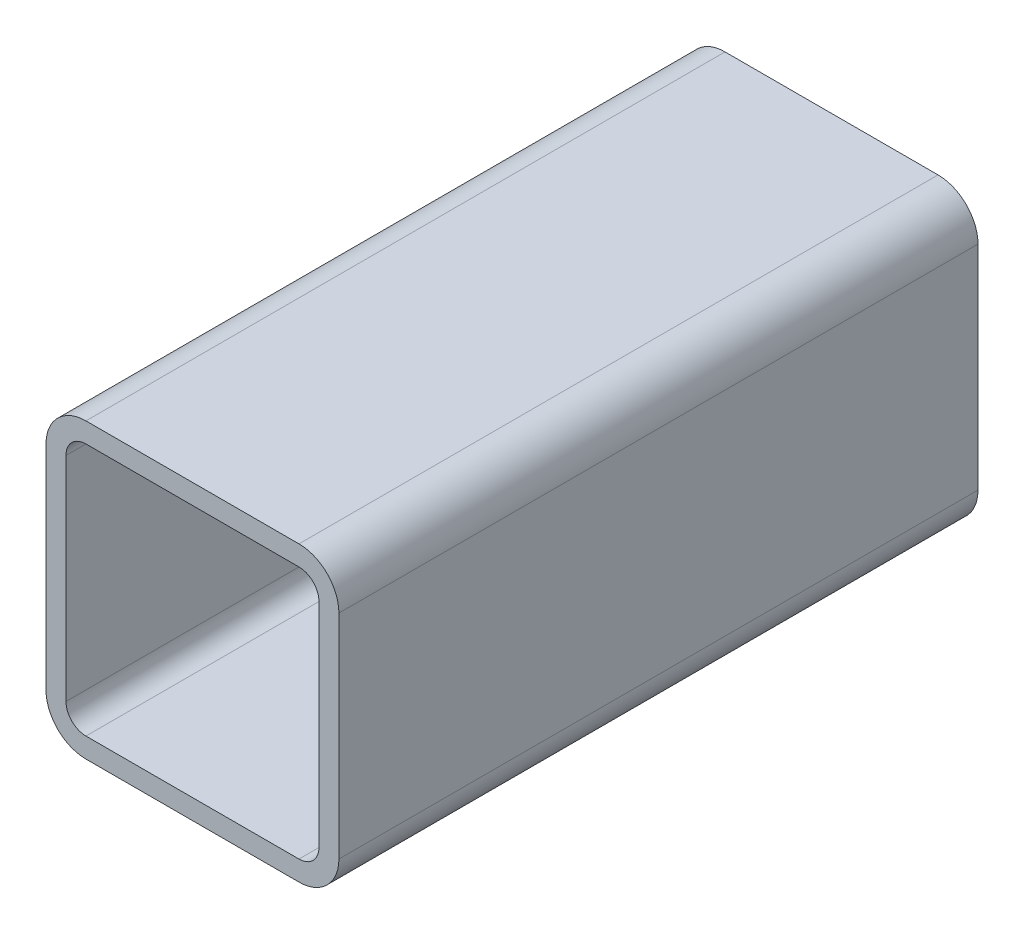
ISO-10303-21;
HEADER;
FILE_DESCRIPTION(('STEP AP214'),'2;1');
FILE_NAME('part.step','',(''),(''),'','','');
FILE_SCHEMA(('AUTOMOTIVE_DESIGN { 1 0 10303 214 1 1 1 1 }'));
ENDSEC;
DATA;
#1=APPLICATION_CONTEXT('core data for automotive mechanical design processes');
#2=APPLICATION_PROTOCOL_DEFINITION('international standard','automotive_design',2000,#1);
#3=PRODUCT_CONTEXT('',#1,'mechanical');
#4=PRODUCT('Part','Part','',(#3));
#5=PRODUCT_RELATED_PRODUCT_CATEGORY('part','',(#4));
#6=PRODUCT_DEFINITION_FORMATION('','',#4);
#7=PRODUCT_DEFINITION_CONTEXT('part definition',#1,'design');
#8=PRODUCT_DEFINITION('design','',#6,#7);
#9=PRODUCT_DEFINITION_SHAPE('','',#8);
#10=(LENGTH_UNIT() NAMED_UNIT(*) SI_UNIT(.MILLI.,.METRE.));
#11=(NAMED_UNIT(*) PLANE_ANGLE_UNIT() SI_UNIT($,.RADIAN.));
#12=(NAMED_UNIT(*) SI_UNIT($,.STERADIAN.) SOLID_ANGLE_UNIT());
#13=UNCERTAINTY_MEASURE_WITH_UNIT(LENGTH_MEASURE(1.E-05),#10,'distance_accuracy_value','');
#14=(GEOMETRIC_REPRESENTATION_CONTEXT(3) GLOBAL_UNCERTAINTY_ASSIGNED_CONTEXT((#13)) GLOBAL_UNIT_ASSIGNED_CONTEXT((#10,
#11,#12)) REPRESENTATION_CONTEXT('',''));
#15=CARTESIAN_POINT('',(0.,0.,0.));
#16=DIRECTION('',(0.,0.,1.));
#17=DIRECTION('',(1.,0.,0.));
#18=AXIS2_PLACEMENT_3D('',#15,#16,#17);
#19=CARTESIAN_POINT('',(19.5042705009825,121.405693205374,304.8));
#20=DIRECTION('',(0.,0.,1.));
#21=DIRECTION('',(1.,0.,0.));
#22=AXIS2_PLACEMENT_3D('',#19,#20,#21);
#23=PLANE('',#22);
#24=CARTESIAN_POINT('',(19.5042705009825,121.405693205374,304.8));
#25=DIRECTION('',(0.,0.,1.));
#26=DIRECTION('',(1.,0.,0.));
#27=AXIS2_PLACEMENT_3D('',#24,#25,#26);
#28=CIRCLE('',#27,19.05);
#29=CARTESIAN_POINT('',(19.5042705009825,140.455693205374,304.8));
#30=VERTEX_POINT('',#29);
#31=CARTESIAN_POINT('',(0.454270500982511,121.405693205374,304.8));
#32=VERTEX_POINT('',#31);
#33=EDGE_CURVE('E211',#30,#32,#28,.T.);
#34=ORIENTED_EDGE('',*,*,#33,.T.);
#35=DIRECTION('',(0.,-1.,0.));
#36=VECTOR('',#35,1.);
#37=CARTESIAN_POINT('',(0.454270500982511,19.8056932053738,304.8));
#38=LINE('',#37,#36);
#39=CARTESIAN_POINT('',(0.454270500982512,19.8056932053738,304.8));
#40=VERTEX_POINT('',#39);
#41=EDGE_CURVE('E214',#32,#40,#38,.T.);
#42=ORIENTED_EDGE('',*,*,#41,.T.);
#43=CARTESIAN_POINT('',(19.5042705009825,19.8056932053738,304.8));
#44=DIRECTION('',(0.,0.,1.));
#45=DIRECTION('',(1.,0.,0.));
#46=AXIS2_PLACEMENT_3D('',#43,#44,#45);
#47=CIRCLE('',#46,19.05);
#48=CARTESIAN_POINT('',(19.5042705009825,0.755693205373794,304.8));
#49=VERTEX_POINT('',#48);
#50=EDGE_CURVE('E217',#40,#49,#47,.T.);
#51=ORIENTED_EDGE('',*,*,#50,.T.);
#52=DIRECTION('',(1.,0.,0.));
#53=VECTOR('',#52,1.);
#54=CARTESIAN_POINT('',(121.104270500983,0.755693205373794,304.8));
#55=LINE('',#54,#53);
#56=CARTESIAN_POINT('',(121.104270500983,0.755693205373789,304.8));
#57=VERTEX_POINT('',#56);
#58=EDGE_CURVE('E219',#49,#57,#55,.T.);
#59=ORIENTED_EDGE('',*,*,#58,.T.);
#60=CARTESIAN_POINT('',(121.104270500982,19.8056932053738,304.8));
#61=DIRECTION('',(0.,0.,1.));
#62=DIRECTION('',(1.,0.,0.));
#63=AXIS2_PLACEMENT_3D('',#60,#61,#62);
#64=CIRCLE('',#63,19.05);
#65=CARTESIAN_POINT('',(140.154270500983,19.8056932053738,304.8));
#66=VERTEX_POINT('',#65);
#67=EDGE_CURVE('E221',#57,#66,#64,.T.);
#68=ORIENTED_EDGE('',*,*,#67,.T.);
#69=DIRECTION('',(0.,1.,0.));
#70=VECTOR('',#69,1.);
#71=CARTESIAN_POINT('',(140.154270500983,121.405693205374,304.8));
#72=LINE('',#71,#70);
#73=CARTESIAN_POINT('',(140.154270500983,121.405693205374,304.8));
#74=VERTEX_POINT('',#73);
#75=EDGE_CURVE('E223',#66,#74,#72,.T.);
#76=ORIENTED_EDGE('',*,*,#75,.T.);
#77=CARTESIAN_POINT('',(121.104270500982,121.405693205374,304.8));
#78=DIRECTION('',(0.,0.,1.));
#79=DIRECTION('',(1.,0.,0.));
#80=AXIS2_PLACEMENT_3D('',#77,#78,#79);
#81=CIRCLE('',#80,19.05);
#82=CARTESIAN_POINT('',(121.104270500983,140.455693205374,304.8));
#83=VERTEX_POINT('',#82);
#84=EDGE_CURVE('E225',#74,#83,#81,.T.);
#85=ORIENTED_EDGE('',*,*,#84,.T.);
#86=DIRECTION('',(-1.,0.,0.));
#87=VECTOR('',#86,1.);
#88=CARTESIAN_POINT('',(19.5042705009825,140.455693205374,304.8));
#89=LINE('',#88,#87);
#90=EDGE_CURVE('E227',#83,#30,#89,.T.);
#91=ORIENTED_EDGE('',*,*,#90,.T.);
#92=EDGE_LOOP('',(#34,#42,#51,#59,#68,#76,#85,#91));
#93=FACE_BOUND('',#92,.T.);
#94=DIRECTION('',(0.,-1.,0.));
#95=VECTOR('',#94,1.);
#96=CARTESIAN_POINT('',(9.97927050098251,19.8056932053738,304.8));
#97=LINE('',#96,#95);
#98=CARTESIAN_POINT('',(9.97927050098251,121.405693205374,304.8));
#99=VERTEX_POINT('',#98);
#100=CARTESIAN_POINT('',(9.97927050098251,19.8056932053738,304.8));
#101=VERTEX_POINT('',#100);
#102=EDGE_CURVE('E154',#99,#101,#97,.T.);
#103=ORIENTED_EDGE('',*,*,#102,.F.);
#104=CARTESIAN_POINT('',(19.5042705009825,121.405693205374,304.8));
#105=DIRECTION('',(0.,0.,1.));
#106=DIRECTION('',(1.,0.,0.));
#107=AXIS2_PLACEMENT_3D('',#104,#105,#106);
#108=CIRCLE('',#107,9.52500000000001);
#109=CARTESIAN_POINT('',(19.5042705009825,130.930693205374,304.8));
#110=VERTEX_POINT('',#109);
#111=EDGE_CURVE('E146',#110,#99,#108,.T.);
#112=ORIENTED_EDGE('',*,*,#111,.F.);
#113=DIRECTION('',(-1.,0.,0.));
#114=VECTOR('',#113,1.);
#115=CARTESIAN_POINT('',(19.5042705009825,130.930693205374,304.8));
#116=LINE('',#115,#114);
#117=CARTESIAN_POINT('',(121.104270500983,130.930693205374,304.8));
#118=VERTEX_POINT('',#117);
#119=EDGE_CURVE('E179',#118,#110,#116,.T.);
#120=ORIENTED_EDGE('',*,*,#119,.F.);
#121=CARTESIAN_POINT('',(121.104270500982,121.405693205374,304.8));
#122=DIRECTION('',(0.,0.,1.));
#123=DIRECTION('',(1.,0.,0.));
#124=AXIS2_PLACEMENT_3D('',#121,#122,#123);
#125=CIRCLE('',#124,9.52500000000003);
#126=CARTESIAN_POINT('',(130.629270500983,121.405693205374,304.8));
#127=VERTEX_POINT('',#126);
#128=EDGE_CURVE('E177',#127,#118,#125,.T.);
#129=ORIENTED_EDGE('',*,*,#128,.F.);
#130=DIRECTION('',(0.,1.,0.));
#131=VECTOR('',#130,1.);
#132=CARTESIAN_POINT('',(130.629270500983,121.405693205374,304.8));
#133=LINE('',#132,#131);
#134=CARTESIAN_POINT('',(130.629270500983,19.8056932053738,304.8));
#135=VERTEX_POINT('',#134);
#136=EDGE_CURVE('E175',#135,#127,#133,.T.);
#137=ORIENTED_EDGE('',*,*,#136,.F.);
#138=CARTESIAN_POINT('',(121.104270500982,19.8056932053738,304.8));
#139=DIRECTION('',(0.,0.,1.));
#140=DIRECTION('',(1.,0.,0.));
#141=AXIS2_PLACEMENT_3D('',#138,#139,#140);
#142=CIRCLE('',#141,9.52500000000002);
#143=CARTESIAN_POINT('',(121.104270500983,10.2806932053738,304.8));
#144=VERTEX_POINT('',#143);
#145=EDGE_CURVE('E173',#144,#135,#142,.T.);
#146=ORIENTED_EDGE('',*,*,#145,.F.);
#147=DIRECTION('',(1.,0.,0.));
#148=VECTOR('',#147,1.);
#149=CARTESIAN_POINT('',(121.104270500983,10.2806932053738,304.8));
#150=LINE('',#149,#148);
#151=CARTESIAN_POINT('',(19.5042705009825,10.2806932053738,304.8));
#152=VERTEX_POINT('',#151);
#153=EDGE_CURVE('E169',#152,#144,#150,.T.);
#154=ORIENTED_EDGE('',*,*,#153,.F.);
#155=CARTESIAN_POINT('',(19.5042705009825,19.8056932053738,304.8));
#156=DIRECTION('',(0.,0.,1.));
#157=DIRECTION('',(1.,0.,0.));
#158=AXIS2_PLACEMENT_3D('',#155,#156,#157);
#159=CIRCLE('',#158,9.525);
#160=EDGE_CURVE('E167',#101,#152,#159,.T.);
#161=ORIENTED_EDGE('',*,*,#160,.F.);
#162=EDGE_LOOP('',(#103,#112,#120,#129,#137,#146,#154,#161));
#163=FACE_BOUND('',#162,.T.);
#164=ADVANCED_FACE('F33',(#93,#163),#23,.T.);
#165=CARTESIAN_POINT('',(19.5042705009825,121.405693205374,0.));
#166=DIRECTION('',(0.,0.,1.));
#167=DIRECTION('',(1.,0.,0.));
#168=AXIS2_PLACEMENT_3D('',#165,#166,#167);
#169=PLANE('',#168);
#170=CARTESIAN_POINT('',(19.5042705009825,121.405693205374,0.));
#171=DIRECTION('',(0.,0.,1.));
#172=DIRECTION('',(1.,0.,0.));
#173=AXIS2_PLACEMENT_3D('',#170,#171,#172);
#174=CIRCLE('',#173,19.05);
#175=CARTESIAN_POINT('',(19.5042705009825,140.455693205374,0.));
#176=VERTEX_POINT('',#175);
#177=CARTESIAN_POINT('',(0.454270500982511,121.405693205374,0.));
#178=VERTEX_POINT('',#177);
#179=EDGE_CURVE('E162',#176,#178,#174,.T.);
#180=ORIENTED_EDGE('',*,*,#179,.F.);
#181=DIRECTION('',(-1.,0.,0.));
#182=VECTOR('',#181,1.);
#183=CARTESIAN_POINT('',(19.5042705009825,140.455693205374,0.));
#184=LINE('',#183,#182);
#185=CARTESIAN_POINT('',(121.104270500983,140.455693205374,0.));
#186=VERTEX_POINT('',#185);
#187=EDGE_CURVE('E215',#186,#176,#184,.T.);
#188=ORIENTED_EDGE('',*,*,#187,.F.);
#189=CARTESIAN_POINT('',(121.104270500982,121.405693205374,0.));
#190=DIRECTION('',(0.,0.,1.));
#191=DIRECTION('',(1.,0.,0.));
#192=AXIS2_PLACEMENT_3D('',#189,#190,#191);
#193=CIRCLE('',#192,19.05);
#194=CARTESIAN_POINT('',(140.154270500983,121.405693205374,0.));
#195=VERTEX_POINT('',#194);
#196=EDGE_CURVE('E242',#195,#186,#193,.T.);
#197=ORIENTED_EDGE('',*,*,#196,.F.);
#198=DIRECTION('',(0.,1.,0.));
#199=VECTOR('',#198,1.);
#200=CARTESIAN_POINT('',(140.154270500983,121.405693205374,0.));
#201=LINE('',#200,#199);
#202=CARTESIAN_POINT('',(140.154270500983,19.8056932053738,0.));
#203=VERTEX_POINT('',#202);
#204=EDGE_CURVE('E240',#203,#195,#201,.T.);
#205=ORIENTED_EDGE('',*,*,#204,.F.);
#206=CARTESIAN_POINT('',(121.104270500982,19.8056932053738,0.));
#207=DIRECTION('',(0.,0.,1.));
#208=DIRECTION('',(1.,0.,0.));
#209=AXIS2_PLACEMENT_3D('',#206,#207,#208);
#210=CIRCLE('',#209,19.05);
#211=CARTESIAN_POINT('',(121.104270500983,0.755693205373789,0.));
#212=VERTEX_POINT('',#211);
#213=EDGE_CURVE('E238',#212,#203,#210,.T.);
#214=ORIENTED_EDGE('',*,*,#213,.F.);
#215=DIRECTION('',(1.,0.,0.));
#216=VECTOR('',#215,1.);
#217=CARTESIAN_POINT('',(121.104270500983,0.755693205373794,0.));
#218=LINE('',#217,#216);
#219=CARTESIAN_POINT('',(19.5042705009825,0.755693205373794,0.));
#220=VERTEX_POINT('',#219);
#221=EDGE_CURVE('E236',#220,#212,#218,.T.);
#222=ORIENTED_EDGE('',*,*,#221,.F.);
#223=CARTESIAN_POINT('',(19.5042705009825,19.8056932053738,0.));
#224=DIRECTION('',(0.,0.,1.));
#225=DIRECTION('',(1.,0.,0.));
#226=AXIS2_PLACEMENT_3D('',#223,#224,#225);
#227=CIRCLE('',#226,19.05);
#228=CARTESIAN_POINT('',(0.454270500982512,19.8056932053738,0.));
#229=VERTEX_POINT('',#228);
#230=EDGE_CURVE('E234',#229,#220,#227,.T.);
#231=ORIENTED_EDGE('',*,*,#230,.F.);
#232=DIRECTION('',(0.,-1.,0.));
#233=VECTOR('',#232,1.);
#234=CARTESIAN_POINT('',(0.454270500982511,19.8056932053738,0.));
#235=LINE('',#234,#233);
#236=EDGE_CURVE('E232',#178,#229,#235,.T.);
#237=ORIENTED_EDGE('',*,*,#236,.F.);
#238=EDGE_LOOP('',(#180,#188,#197,#205,#214,#222,#231,#237));
#239=FACE_BOUND('',#238,.T.);
#240=CARTESIAN_POINT('',(19.5042705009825,121.405693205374,0.));
#241=DIRECTION('',(0.,0.,1.));
#242=DIRECTION('',(1.,0.,0.));
#243=AXIS2_PLACEMENT_3D('',#240,#241,#242);
#244=CIRCLE('',#243,9.52500000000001);
#245=CARTESIAN_POINT('',(19.5042705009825,130.930693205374,0.));
#246=VERTEX_POINT('',#245);
#247=CARTESIAN_POINT('',(9.97927050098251,121.405693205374,0.));
#248=VERTEX_POINT('',#247);
#249=EDGE_CURVE('E56',#246,#248,#244,.T.);
#250=ORIENTED_EDGE('',*,*,#249,.T.);
#251=DIRECTION('',(0.,-1.,0.));
#252=VECTOR('',#251,1.);
#253=CARTESIAN_POINT('',(9.97927050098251,19.8056932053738,0.));
#254=LINE('',#253,#252);
#255=CARTESIAN_POINT('',(9.97927050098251,19.8056932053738,0.));
#256=VERTEX_POINT('',#255);
#257=EDGE_CURVE('E161',#248,#256,#254,.T.);
#258=ORIENTED_EDGE('',*,*,#257,.T.);
#259=CARTESIAN_POINT('',(19.5042705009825,19.8056932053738,0.));
#260=DIRECTION('',(0.,0.,1.));
#261=DIRECTION('',(1.,0.,0.));
#262=AXIS2_PLACEMENT_3D('',#259,#260,#261);
#263=CIRCLE('',#262,9.525);
#264=CARTESIAN_POINT('',(19.5042705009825,10.2806932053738,0.));
#265=VERTEX_POINT('',#264);
#266=EDGE_CURVE('E183',#256,#265,#263,.T.);
#267=ORIENTED_EDGE('',*,*,#266,.T.);
#268=DIRECTION('',(1.,0.,0.));
#269=VECTOR('',#268,1.);
#270=CARTESIAN_POINT('',(121.104270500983,10.2806932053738,0.));
#271=LINE('',#270,#269);
#272=CARTESIAN_POINT('',(121.104270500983,10.2806932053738,0.));
#273=VERTEX_POINT('',#272);
#274=EDGE_CURVE('E186',#265,#273,#271,.T.);
#275=ORIENTED_EDGE('',*,*,#274,.T.);
#276=CARTESIAN_POINT('',(121.104270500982,19.8056932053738,0.));
#277=DIRECTION('',(0.,0.,1.));
#278=DIRECTION('',(1.,0.,0.));
#279=AXIS2_PLACEMENT_3D('',#276,#277,#278);
#280=CIRCLE('',#279,9.52500000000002);
#281=CARTESIAN_POINT('',(130.629270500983,19.8056932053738,0.));
#282=VERTEX_POINT('',#281);
#283=EDGE_CURVE('E189',#273,#282,#280,.T.);
#284=ORIENTED_EDGE('',*,*,#283,.T.);
#285=DIRECTION('',(0.,1.,0.));
#286=VECTOR('',#285,1.);
#287=CARTESIAN_POINT('',(130.629270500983,121.405693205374,0.));
#288=LINE('',#287,#286);
#289=CARTESIAN_POINT('',(130.629270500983,121.405693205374,0.));
#290=VERTEX_POINT('',#289);
#291=EDGE_CURVE('E192',#282,#290,#288,.T.);
#292=ORIENTED_EDGE('',*,*,#291,.T.);
#293=CARTESIAN_POINT('',(121.104270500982,121.405693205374,0.));
#294=DIRECTION('',(0.,0.,1.));
#295=DIRECTION('',(1.,0.,0.));
#296=AXIS2_PLACEMENT_3D('',#293,#294,#295);
#297=CIRCLE('',#296,9.52500000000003);
#298=CARTESIAN_POINT('',(121.104270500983,130.930693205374,0.));
#299=VERTEX_POINT('',#298);
#300=EDGE_CURVE('E195',#290,#299,#297,.T.);
#301=ORIENTED_EDGE('',*,*,#300,.T.);
#302=DIRECTION('',(-1.,0.,0.));
#303=VECTOR('',#302,1.);
#304=CARTESIAN_POINT('',(19.5042705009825,130.930693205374,0.));
#305=LINE('',#304,#303);
#306=EDGE_CURVE('E155',#299,#246,#305,.T.);
#307=ORIENTED_EDGE('',*,*,#306,.T.);
#308=EDGE_LOOP('',(#250,#258,#267,#275,#284,#292,#301,#307));
#309=FACE_BOUND('',#308,.T.);
#310=ADVANCED_FACE('F272',(#239,#309),#169,.F.);
#311=CARTESIAN_POINT('',(19.5042705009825,121.405693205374,304.8));
#312=DIRECTION('',(0.,0.,-1.));
#313=DIRECTION('',(-1.,0.,0.));
#314=AXIS2_PLACEMENT_3D('',#311,#312,#313);
#315=CYLINDRICAL_SURFACE('',#314,19.05);
#316=ORIENTED_EDGE('',*,*,#179,.T.);
#317=DIRECTION('',(0.,0.,-1.));
#318=VECTOR('',#317,1.);
#319=CARTESIAN_POINT('',(0.454270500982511,121.405693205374,304.8));
#320=LINE('',#319,#318);
#321=EDGE_CURVE('E11',#32,#178,#320,.T.);
#322=ORIENTED_EDGE('',*,*,#321,.F.);
#323=ORIENTED_EDGE('',*,*,#33,.F.);
#324=DIRECTION('',(0.,0.,-1.));
#325=VECTOR('',#324,1.);
#326=CARTESIAN_POINT('',(19.5042705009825,140.455693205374,304.8));
#327=LINE('',#326,#325);
#328=EDGE_CURVE('E229',#30,#176,#327,.T.);
#329=ORIENTED_EDGE('',*,*,#328,.T.);
#330=EDGE_LOOP('',(#316,#322,#323,#329));
#331=FACE_BOUND('',#330,.T.);
#332=ADVANCED_FACE('F35',(#331),#315,.T.);
#333=CARTESIAN_POINT('',(0.454270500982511,19.8056932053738,304.8));
#334=DIRECTION('',(1.,0.,0.));
#335=DIRECTION('',(0.,0.,-1.));
#336=AXIS2_PLACEMENT_3D('',#333,#334,#335);
#337=PLANE('',#336);
#338=ORIENTED_EDGE('',*,*,#236,.T.);
#339=DIRECTION('',(0.,0.,-1.));
#340=VECTOR('',#339,1.);
#341=CARTESIAN_POINT('',(0.454270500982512,19.8056932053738,304.8));
#342=LINE('',#341,#340);
#343=EDGE_CURVE('E41',#40,#229,#342,.T.);
#344=ORIENTED_EDGE('',*,*,#343,.F.);
#345=ORIENTED_EDGE('',*,*,#41,.F.);
#346=ORIENTED_EDGE('',*,*,#321,.T.);
#347=EDGE_LOOP('',(#338,#344,#345,#346));
#348=FACE_BOUND('',#347,.T.);
#349=ADVANCED_FACE('F289',(#348),#337,.F.);
#350=CARTESIAN_POINT('',(19.5042705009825,19.8056932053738,304.8));
#351=DIRECTION('',(0.,0.,-1.));
#352=DIRECTION('',(-1.,0.,0.));
#353=AXIS2_PLACEMENT_3D('',#350,#351,#352);
#354=CYLINDRICAL_SURFACE('',#353,19.05);
#355=ORIENTED_EDGE('',*,*,#230,.T.);
#356=DIRECTION('',(0.,0.,-1.));
#357=VECTOR('',#356,1.);
#358=CARTESIAN_POINT('',(19.5042705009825,0.755693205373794,304.8));
#359=LINE('',#358,#357);
#360=EDGE_CURVE('E259',#49,#220,#359,.T.);
#361=ORIENTED_EDGE('',*,*,#360,.F.);
#362=ORIENTED_EDGE('',*,*,#50,.F.);
#363=ORIENTED_EDGE('',*,*,#343,.T.);
#364=EDGE_LOOP('',(#355,#361,#362,#363));
#365=FACE_BOUND('',#364,.T.);
#366=ADVANCED_FACE('F266',(#365),#354,.T.);
#367=CARTESIAN_POINT('',(121.104270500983,0.755693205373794,304.8));
#368=DIRECTION('',(0.,1.,0.));
#369=DIRECTION('',(0.,0.,1.));
#370=AXIS2_PLACEMENT_3D('',#367,#368,#369);
#371=PLANE('',#370);
#372=ORIENTED_EDGE('',*,*,#221,.T.);
#373=DIRECTION('',(0.,0.,-1.));
#374=VECTOR('',#373,1.);
#375=CARTESIAN_POINT('',(121.104270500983,0.755693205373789,304.8));
#376=LINE('',#375,#374);
#377=EDGE_CURVE('E256',#57,#212,#376,.T.);
#378=ORIENTED_EDGE('',*,*,#377,.F.);
#379=ORIENTED_EDGE('',*,*,#58,.F.);
#380=ORIENTED_EDGE('',*,*,#360,.T.);
#381=EDGE_LOOP('',(#372,#378,#379,#380));
#382=FACE_BOUND('',#381,.T.);
#383=ADVANCED_FACE('F278',(#382),#371,.F.);
#384=CARTESIAN_POINT('',(121.104270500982,19.8056932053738,304.8));
#385=DIRECTION('',(0.,0.,-1.));
#386=DIRECTION('',(-1.,0.,0.));
#387=AXIS2_PLACEMENT_3D('',#384,#385,#386);
#388=CYLINDRICAL_SURFACE('',#387,19.05);
#389=ORIENTED_EDGE('',*,*,#213,.T.);
#390=DIRECTION('',(0.,0.,-1.));
#391=VECTOR('',#390,1.);
#392=CARTESIAN_POINT('',(140.154270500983,19.8056932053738,304.8));
#393=LINE('',#392,#391);
#394=EDGE_CURVE('E253',#66,#203,#393,.T.);
#395=ORIENTED_EDGE('',*,*,#394,.F.);
#396=ORIENTED_EDGE('',*,*,#67,.F.);
#397=ORIENTED_EDGE('',*,*,#377,.T.);
#398=EDGE_LOOP('',(#389,#395,#396,#397));
#399=FACE_BOUND('',#398,.T.);
#400=ADVANCED_FACE('F282',(#399),#388,.T.);
#401=CARTESIAN_POINT('',(140.154270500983,121.405693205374,304.8));
#402=DIRECTION('',(-1.,0.,0.));
#403=DIRECTION('',(0.,0.,1.));
#404=AXIS2_PLACEMENT_3D('',#401,#402,#403);
#405=PLANE('',#404);
#406=ORIENTED_EDGE('',*,*,#204,.T.);
#407=DIRECTION('',(0.,0.,-1.));
#408=VECTOR('',#407,1.);
#409=CARTESIAN_POINT('',(140.154270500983,121.405693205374,304.8));
#410=LINE('',#409,#408);
#411=EDGE_CURVE('E250',#74,#195,#410,.T.);
#412=ORIENTED_EDGE('',*,*,#411,.F.);
#413=ORIENTED_EDGE('',*,*,#75,.F.);
#414=ORIENTED_EDGE('',*,*,#394,.T.);
#415=EDGE_LOOP('',(#406,#412,#413,#414));
#416=FACE_BOUND('',#415,.T.);
#417=ADVANCED_FACE('F302',(#416),#405,.F.);
#418=CARTESIAN_POINT('',(121.104270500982,121.405693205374,304.8));
#419=DIRECTION('',(0.,0.,-1.));
#420=DIRECTION('',(-1.,0.,0.));
#421=AXIS2_PLACEMENT_3D('',#418,#419,#420);
#422=CYLINDRICAL_SURFACE('',#421,19.05);
#423=ORIENTED_EDGE('',*,*,#196,.T.);
#424=DIRECTION('',(0.,0.,-1.));
#425=VECTOR('',#424,1.);
#426=CARTESIAN_POINT('',(121.104270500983,140.455693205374,304.8));
#427=LINE('',#426,#425);
#428=EDGE_CURVE('E247',#83,#186,#427,.T.);
#429=ORIENTED_EDGE('',*,*,#428,.F.);
#430=ORIENTED_EDGE('',*,*,#84,.F.);
#431=ORIENTED_EDGE('',*,*,#411,.T.);
#432=EDGE_LOOP('',(#423,#429,#430,#431));
#433=FACE_BOUND('',#432,.T.);
#434=ADVANCED_FACE('F300',(#433),#422,.T.);
#435=CARTESIAN_POINT('',(19.5042705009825,140.455693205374,304.8));
#436=DIRECTION('',(0.,-1.,0.));
#437=DIRECTION('',(0.,0.,-1.));
#438=AXIS2_PLACEMENT_3D('',#435,#436,#437);
#439=PLANE('',#438);
#440=ORIENTED_EDGE('',*,*,#187,.T.);
#441=ORIENTED_EDGE('',*,*,#328,.F.);
#442=ORIENTED_EDGE('',*,*,#90,.F.);
#443=ORIENTED_EDGE('',*,*,#428,.T.);
#444=EDGE_LOOP('',(#440,#441,#442,#443));
#445=FACE_BOUND('',#444,.T.);
#446=ADVANCED_FACE('F295',(#445),#439,.F.);
#447=CARTESIAN_POINT('',(19.5042705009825,121.405693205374,304.8));
#448=DIRECTION('',(0.,0.,-1.));
#449=DIRECTION('',(-1.,0.,0.));
#450=AXIS2_PLACEMENT_3D('',#447,#448,#449);
#451=CYLINDRICAL_SURFACE('',#450,9.52500000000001);
#452=ORIENTED_EDGE('',*,*,#249,.F.);
#453=DIRECTION('',(0.,0.,-1.));
#454=VECTOR('',#453,1.);
#455=CARTESIAN_POINT('',(19.5042705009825,130.930693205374,304.8));
#456=LINE('',#455,#454);
#457=EDGE_CURVE('E150',#110,#246,#456,.T.);
#458=ORIENTED_EDGE('',*,*,#457,.F.);
#459=ORIENTED_EDGE('',*,*,#111,.T.);
#460=DIRECTION('',(0.,0.,-1.));
#461=VECTOR('',#460,1.);
#462=CARTESIAN_POINT('',(9.97927050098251,121.405693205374,304.8));
#463=LINE('',#462,#461);
#464=EDGE_CURVE('E149',#99,#248,#463,.T.);
#465=ORIENTED_EDGE('',*,*,#464,.T.);
#466=EDGE_LOOP('',(#452,#458,#459,#465));
#467=FACE_BOUND('',#466,.T.);
#468=ADVANCED_FACE('F148',(#467),#451,.F.);
#469=CARTESIAN_POINT('',(9.97927050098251,19.8056932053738,304.8));
#470=DIRECTION('',(1.,0.,0.));
#471=DIRECTION('',(0.,0.,-1.));
#472=AXIS2_PLACEMENT_3D('',#469,#470,#471);
#473=PLANE('',#472);
#474=ORIENTED_EDGE('',*,*,#257,.F.);
#475=ORIENTED_EDGE('',*,*,#464,.F.);
#476=ORIENTED_EDGE('',*,*,#102,.T.);
#477=DIRECTION('',(0.,0.,-1.));
#478=VECTOR('',#477,1.);
#479=CARTESIAN_POINT('',(9.97927050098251,19.8056932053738,304.8));
#480=LINE('',#479,#478);
#481=EDGE_CURVE('E163',#101,#256,#480,.T.);
#482=ORIENTED_EDGE('',*,*,#481,.T.);
#483=EDGE_LOOP('',(#474,#475,#476,#482));
#484=FACE_BOUND('',#483,.T.);
#485=ADVANCED_FACE('F158',(#484),#473,.T.);
#486=CARTESIAN_POINT('',(19.5042705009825,19.8056932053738,304.8));
#487=DIRECTION('',(0.,0.,-1.));
#488=DIRECTION('',(-1.,0.,0.));
#489=AXIS2_PLACEMENT_3D('',#486,#487,#488);
#490=CYLINDRICAL_SURFACE('',#489,9.525);
#491=ORIENTED_EDGE('',*,*,#266,.F.);
#492=ORIENTED_EDGE('',*,*,#481,.F.);
#493=ORIENTED_EDGE('',*,*,#160,.T.);
#494=DIRECTION('',(0.,0.,-1.));
#495=VECTOR('',#494,1.);
#496=CARTESIAN_POINT('',(19.5042705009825,10.2806932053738,304.8));
#497=LINE('',#496,#495);
#498=EDGE_CURVE('E208',#152,#265,#497,.T.);
#499=ORIENTED_EDGE('',*,*,#498,.T.);
#500=EDGE_LOOP('',(#491,#492,#493,#499));
#501=FACE_BOUND('',#500,.T.);
#502=ADVANCED_FACE('F327',(#501),#490,.F.);
#503=CARTESIAN_POINT('',(121.104270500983,10.2806932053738,304.8));
#504=DIRECTION('',(0.,1.,0.));
#505=DIRECTION('',(0.,0.,1.));
#506=AXIS2_PLACEMENT_3D('',#503,#504,#505);
#507=PLANE('',#506);
#508=ORIENTED_EDGE('',*,*,#274,.F.);
#509=ORIENTED_EDGE('',*,*,#498,.F.);
#510=ORIENTED_EDGE('',*,*,#153,.T.);
#511=DIRECTION('',(0.,0.,-1.));
#512=VECTOR('',#511,1.);
#513=CARTESIAN_POINT('',(121.104270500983,10.2806932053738,304.8));
#514=LINE('',#513,#512);
#515=EDGE_CURVE('E206',#144,#273,#514,.T.);
#516=ORIENTED_EDGE('',*,*,#515,.T.);
#517=EDGE_LOOP('',(#508,#509,#510,#516));
#518=FACE_BOUND('',#517,.T.);
#519=ADVANCED_FACE('F331',(#518),#507,.T.);
#520=CARTESIAN_POINT('',(121.104270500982,19.8056932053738,304.8));
#521=DIRECTION('',(0.,0.,-1.));
#522=DIRECTION('',(-1.,0.,0.));
#523=AXIS2_PLACEMENT_3D('',#520,#521,#522);
#524=CYLINDRICAL_SURFACE('',#523,9.52500000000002);
#525=ORIENTED_EDGE('',*,*,#283,.F.);
#526=ORIENTED_EDGE('',*,*,#515,.F.);
#527=ORIENTED_EDGE('',*,*,#145,.T.);
#528=DIRECTION('',(0.,0.,-1.));
#529=VECTOR('',#528,1.);
#530=CARTESIAN_POINT('',(130.629270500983,19.8056932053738,304.8));
#531=LINE('',#530,#529);
#532=EDGE_CURVE('E204',#135,#282,#531,.T.);
#533=ORIENTED_EDGE('',*,*,#532,.T.);
#534=EDGE_LOOP('',(#525,#526,#527,#533));
#535=FACE_BOUND('',#534,.T.);
#536=ADVANCED_FACE('F337',(#535),#524,.F.);
#537=CARTESIAN_POINT('',(130.629270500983,121.405693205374,304.8));
#538=DIRECTION('',(-1.,0.,0.));
#539=DIRECTION('',(0.,0.,1.));
#540=AXIS2_PLACEMENT_3D('',#537,#538,#539);
#541=PLANE('',#540);
#542=ORIENTED_EDGE('',*,*,#291,.F.);
#543=ORIENTED_EDGE('',*,*,#532,.F.);
#544=ORIENTED_EDGE('',*,*,#136,.T.);
#545=DIRECTION('',(0.,0.,-1.));
#546=VECTOR('',#545,1.);
#547=CARTESIAN_POINT('',(130.629270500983,121.405693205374,304.8));
#548=LINE('',#547,#546);
#549=EDGE_CURVE('E202',#127,#290,#548,.T.);
#550=ORIENTED_EDGE('',*,*,#549,.T.);
#551=EDGE_LOOP('',(#542,#543,#544,#550));
#552=FACE_BOUND('',#551,.T.);
#553=ADVANCED_FACE('F341',(#552),#541,.T.);
#554=CARTESIAN_POINT('',(121.104270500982,121.405693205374,304.8));
#555=DIRECTION('',(0.,0.,-1.));
#556=DIRECTION('',(-1.,0.,0.));
#557=AXIS2_PLACEMENT_3D('',#554,#555,#556);
#558=CYLINDRICAL_SURFACE('',#557,9.52500000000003);
#559=ORIENTED_EDGE('',*,*,#300,.F.);
#560=ORIENTED_EDGE('',*,*,#549,.F.);
#561=ORIENTED_EDGE('',*,*,#128,.T.);
#562=DIRECTION('',(0.,0.,-1.));
#563=VECTOR('',#562,1.);
#564=CARTESIAN_POINT('',(121.104270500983,130.930693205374,304.8));
#565=LINE('',#564,#563);
#566=EDGE_CURVE('E48',#118,#299,#565,.T.);
#567=ORIENTED_EDGE('',*,*,#566,.T.);
#568=EDGE_LOOP('',(#559,#560,#561,#567));
#569=FACE_BOUND('',#568,.T.);
#570=ADVANCED_FACE('F345',(#569),#558,.F.);
#571=CARTESIAN_POINT('',(19.5042705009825,130.930693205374,304.8));
#572=DIRECTION('',(0.,-1.,0.));
#573=DIRECTION('',(0.,0.,-1.));
#574=AXIS2_PLACEMENT_3D('',#571,#572,#573);
#575=PLANE('',#574);
#576=ORIENTED_EDGE('',*,*,#306,.F.);
#577=ORIENTED_EDGE('',*,*,#566,.F.);
#578=ORIENTED_EDGE('',*,*,#119,.T.);
#579=ORIENTED_EDGE('',*,*,#457,.T.);
#580=EDGE_LOOP('',(#576,#577,#578,#579));
#581=FACE_BOUND('',#580,.T.);
#582=ADVANCED_FACE('F349',(#581),#575,.T.);
#583=CLOSED_SHELL('',(#164,#310,#332,#349,#366,#383,#400,#417,#434,#446,#468,#485,#502,#519,
#536,#553,#570,#582));
#584=MANIFOLD_SOLID_BREP('B2',#583);
#585=ADVANCED_BREP_SHAPE_REPRESENTATION('',(#18,#584),#14);
#586=SHAPE_DEFINITION_REPRESENTATION(#9,#585);
ENDSEC;
END-ISO-10303-21;
